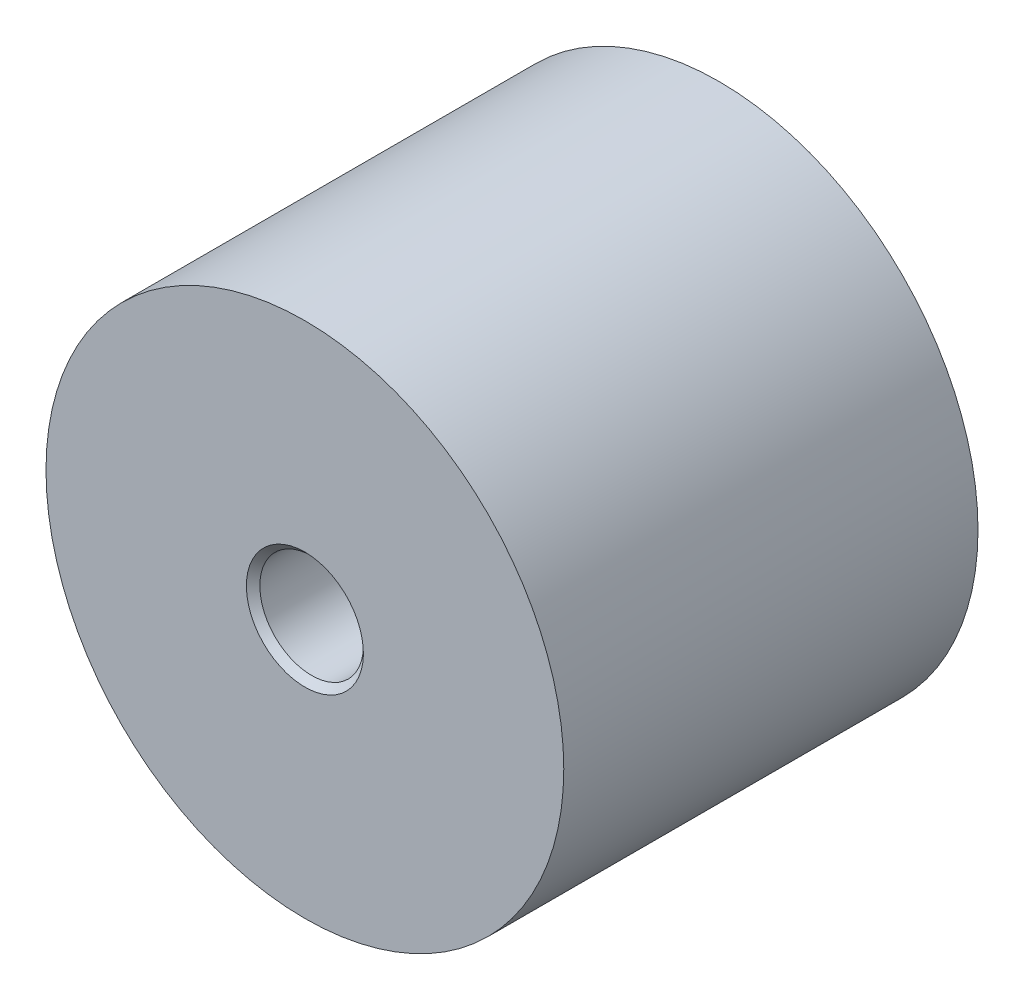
ISO-10303-21;
HEADER;
FILE_DESCRIPTION(('STEP AP214'),'2;1');
FILE_NAME('part.step','',(''),(''),'','','');
FILE_SCHEMA(('AUTOMOTIVE_DESIGN { 1 0 10303 214 1 1 1 1 }'));
ENDSEC;
DATA;
#1=APPLICATION_CONTEXT('core data for automotive mechanical design processes');
#2=APPLICATION_PROTOCOL_DEFINITION('international standard','automotive_design',2000,#1);
#3=PRODUCT_CONTEXT('',#1,'mechanical');
#4=PRODUCT('Part','Part','',(#3));
#5=PRODUCT_RELATED_PRODUCT_CATEGORY('part','',(#4));
#6=PRODUCT_DEFINITION_FORMATION('','',#4);
#7=PRODUCT_DEFINITION_CONTEXT('part definition',#1,'design');
#8=PRODUCT_DEFINITION('design','',#6,#7);
#9=PRODUCT_DEFINITION_SHAPE('','',#8);
#10=(LENGTH_UNIT() NAMED_UNIT(*) SI_UNIT(.MILLI.,.METRE.));
#11=(NAMED_UNIT(*) PLANE_ANGLE_UNIT() SI_UNIT($,.RADIAN.));
#12=(NAMED_UNIT(*) SI_UNIT($,.STERADIAN.) SOLID_ANGLE_UNIT());
#13=UNCERTAINTY_MEASURE_WITH_UNIT(LENGTH_MEASURE(1.E-05),#10,'distance_accuracy_value','');
#14=(GEOMETRIC_REPRESENTATION_CONTEXT(3) GLOBAL_UNCERTAINTY_ASSIGNED_CONTEXT((#13)) GLOBAL_UNIT_ASSIGNED_CONTEXT((#10,
#11,#12)) REPRESENTATION_CONTEXT('',''));
#15=CARTESIAN_POINT('',(0.,0.,0.));
#16=DIRECTION('',(0.,0.,1.));
#17=DIRECTION('',(1.,0.,0.));
#18=AXIS2_PLACEMENT_3D('',#15,#16,#17);
#19=CARTESIAN_POINT('',(25.,0.,40.));
#20=DIRECTION('',(0.,0.,1.));
#21=DIRECTION('',(0.,-1.,0.));
#22=AXIS2_PLACEMENT_3D('',#19,#20,#21);
#23=PLANE('',#22);
#24=CARTESIAN_POINT('',(0.,0.,40.));
#25=DIRECTION('',(0.,0.,-1.));
#26=DIRECTION('',(0.,1.,0.));
#27=AXIS2_PLACEMENT_3D('',#24,#25,#26);
#28=CIRCLE('',#27,5.65);
#29=CARTESIAN_POINT('',(0.,5.65,40.));
#30=VERTEX_POINT('',#29);
#31=EDGE_CURVE('E23',#30,#30,#28,.T.);
#32=ORIENTED_EDGE('',*,*,#31,.T.);
#33=EDGE_LOOP('',(#32));
#34=FACE_BOUND('',#33,.T.);
#35=CARTESIAN_POINT('',(0.,0.,40.));
#36=DIRECTION('',(0.,0.,-1.));
#37=DIRECTION('',(0.,1.,0.));
#38=AXIS2_PLACEMENT_3D('',#35,#36,#37);
#39=CIRCLE('',#38,25.);
#40=CARTESIAN_POINT('',(0.,25.,40.));
#41=VERTEX_POINT('',#40);
#42=EDGE_CURVE('E19',#41,#41,#39,.T.);
#43=ORIENTED_EDGE('',*,*,#42,.F.);
#44=EDGE_LOOP('',(#43));
#45=FACE_BOUND('',#44,.T.);
#46=ADVANCED_FACE('F12',(#34,#45),#23,.T.);
#47=CARTESIAN_POINT('',(0.,0.,40.));
#48=DIRECTION('',(0.,0.,1.));
#49=DIRECTION('',(0.,-1.,0.));
#50=AXIS2_PLACEMENT_3D('',#47,#48,#49);
#51=CONICAL_SURFACE('',#50,5.65,0.78539816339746);
#52=CARTESIAN_POINT('',(0.,0.,39.35));
#53=DIRECTION('',(0.,0.,-1.));
#54=DIRECTION('',(0.,1.,0.));
#55=AXIS2_PLACEMENT_3D('',#52,#53,#54);
#56=CIRCLE('',#55,5.);
#57=CARTESIAN_POINT('',(0.,5.,39.35));
#58=VERTEX_POINT('',#57);
#59=EDGE_CURVE('E27',#58,#58,#56,.T.);
#60=ORIENTED_EDGE('',*,*,#59,.T.);
#61=EDGE_LOOP('',(#60));
#62=FACE_BOUND('',#61,.T.);
#63=ORIENTED_EDGE('',*,*,#31,.F.);
#64=EDGE_LOOP('',(#63));
#65=FACE_BOUND('',#64,.T.);
#66=ADVANCED_FACE('F48',(#62,#65),#51,.F.);
#67=CARTESIAN_POINT('',(0.,0.,0.));
#68=DIRECTION('',(0.,0.,-1.));
#69=DIRECTION('',(0.,1.,0.));
#70=AXIS2_PLACEMENT_3D('',#67,#68,#69);
#71=CYLINDRICAL_SURFACE('',#70,5.);
#72=CARTESIAN_POINT('',(0.,0.,30.));
#73=DIRECTION('',(0.,0.,-1.));
#74=DIRECTION('',(0.,1.,0.));
#75=AXIS2_PLACEMENT_3D('',#72,#73,#74);
#76=CIRCLE('',#75,5.);
#77=CARTESIAN_POINT('',(0.,5.,30.));
#78=VERTEX_POINT('',#77);
#79=EDGE_CURVE('E32',#78,#78,#76,.T.);
#80=ORIENTED_EDGE('',*,*,#79,.T.);
#81=EDGE_LOOP('',(#80));
#82=FACE_BOUND('',#81,.T.);
#83=ORIENTED_EDGE('',*,*,#59,.F.);
#84=EDGE_LOOP('',(#83));
#85=FACE_BOUND('',#84,.T.);
#86=ADVANCED_FACE('F36',(#82,#85),#71,.F.);
#87=CARTESIAN_POINT('',(5.,0.,30.));
#88=DIRECTION('',(0.,0.,1.));
#89=DIRECTION('',(0.,-1.,0.));
#90=AXIS2_PLACEMENT_3D('',#87,#88,#89);
#91=PLANE('',#90);
#92=ORIENTED_EDGE('',*,*,#79,.F.);
#93=EDGE_LOOP('',(#92));
#94=FACE_BOUND('',#93,.T.);
#95=ADVANCED_FACE('F39',(#94),#91,.T.);
#96=CARTESIAN_POINT('',(0.,0.,0.));
#97=DIRECTION('',(0.,0.,1.));
#98=DIRECTION('',(0.,-1.,0.));
#99=AXIS2_PLACEMENT_3D('',#96,#97,#98);
#100=CYLINDRICAL_SURFACE('',#99,25.);
#101=CARTESIAN_POINT('',(0.,0.,0.));
#102=DIRECTION('',(0.,0.,1.));
#103=DIRECTION('',(0.,-1.,0.));
#104=AXIS2_PLACEMENT_3D('',#101,#102,#103);
#105=CIRCLE('',#104,25.);
#106=CARTESIAN_POINT('',(0.,-25.,0.));
#107=VERTEX_POINT('',#106);
#108=EDGE_CURVE('E8',#107,#107,#105,.T.);
#109=ORIENTED_EDGE('',*,*,#108,.T.);
#110=EDGE_LOOP('',(#109));
#111=FACE_BOUND('',#110,.T.);
#112=ORIENTED_EDGE('',*,*,#42,.T.);
#113=EDGE_LOOP('',(#112));
#114=FACE_BOUND('',#113,.T.);
#115=ADVANCED_FACE('F14',(#111,#114),#100,.T.);
#116=CARTESIAN_POINT('',(25.,0.,0.));
#117=DIRECTION('',(0.,0.,-1.));
#118=DIRECTION('',(0.,1.,0.));
#119=AXIS2_PLACEMENT_3D('',#116,#117,#118);
#120=PLANE('',#119);
#121=ORIENTED_EDGE('',*,*,#108,.F.);
#122=EDGE_LOOP('',(#121));
#123=FACE_BOUND('',#122,.T.);
#124=ADVANCED_FACE('F47',(#123),#120,.T.);
#125=CLOSED_SHELL('',(#46,#66,#86,#95,#115,#124));
#126=MANIFOLD_SOLID_BREP('B1',#125);
#127=ADVANCED_BREP_SHAPE_REPRESENTATION('',(#18,#126),#14);
#128=SHAPE_DEFINITION_REPRESENTATION(#9,#127);
ENDSEC;
END-ISO-10303-21;
